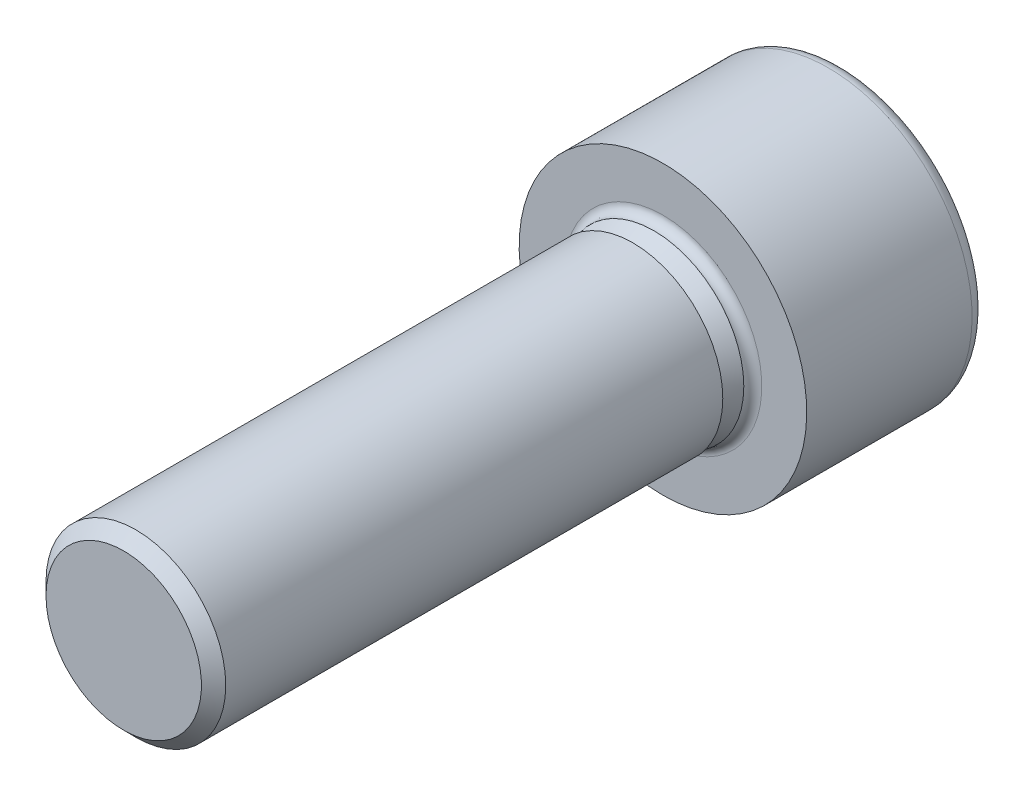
ISO-10303-21;
HEADER;
FILE_DESCRIPTION(('STEP AP214'),'2;1');
FILE_NAME('part.step','',(''),(''),'','','');
FILE_SCHEMA(('AUTOMOTIVE_DESIGN { 1 0 10303 214 1 1 1 1 }'));
ENDSEC;
DATA;
#1=APPLICATION_CONTEXT('core data for automotive mechanical design processes');
#2=APPLICATION_PROTOCOL_DEFINITION('international standard','automotive_design',2000,#1);
#3=PRODUCT_CONTEXT('',#1,'mechanical');
#4=PRODUCT('Part','Part','',(#3));
#5=PRODUCT_RELATED_PRODUCT_CATEGORY('part','',(#4));
#6=PRODUCT_DEFINITION_FORMATION('','',#4);
#7=PRODUCT_DEFINITION_CONTEXT('part definition',#1,'design');
#8=PRODUCT_DEFINITION('design','',#6,#7);
#9=PRODUCT_DEFINITION_SHAPE('','',#8);
#10=(LENGTH_UNIT() NAMED_UNIT(*) SI_UNIT(.MILLI.,.METRE.));
#11=(NAMED_UNIT(*) PLANE_ANGLE_UNIT() SI_UNIT($,.RADIAN.));
#12=(NAMED_UNIT(*) SI_UNIT($,.STERADIAN.) SOLID_ANGLE_UNIT());
#13=UNCERTAINTY_MEASURE_WITH_UNIT(LENGTH_MEASURE(1.E-05),#10,'distance_accuracy_value','');
#14=(GEOMETRIC_REPRESENTATION_CONTEXT(3) GLOBAL_UNCERTAINTY_ASSIGNED_CONTEXT((#13)) GLOBAL_UNIT_ASSIGNED_CONTEXT((#10,
#11,#12)) REPRESENTATION_CONTEXT('',''));
#15=CARTESIAN_POINT('',(0.,0.,0.));
#16=DIRECTION('',(0.,0.,1.));
#17=DIRECTION('',(1.,0.,0.));
#18=AXIS2_PLACEMENT_3D('',#15,#16,#17);
#19=CARTESIAN_POINT('',(0.,0.,-5.01600415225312));
#20=DIRECTION('',(0.,0.,-1.));
#21=DIRECTION('',(0.,1.,0.));
#22=AXIS2_PLACEMENT_3D('',#19,#20,#21);
#23=CONICAL_SURFACE('',#22,4.64771999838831,1.0471975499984);
#24=CARTESIAN_POINT('',(4.62000000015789,-1.08576122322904E-09,-5.00000000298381));
#25=CARTESIAN_POINT('',(4.51848948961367,-0.175821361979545,-4.94137589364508));
#26=CARTESIAN_POINT('',(4.41610274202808,-0.353160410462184,-4.88806033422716));
#27=CARTESIAN_POINT('',(4.2095564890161,-0.710909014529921,-4.79499962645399));
#28=CARTESIAN_POINT('',(4.1053933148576,-0.891324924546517,-4.7552873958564));
#29=CARTESIAN_POINT('',(3.89835780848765,-1.24992094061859,-4.6934724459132));
#30=CARTESIAN_POINT('',(3.7955173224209,-1.42804588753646,-4.67095826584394));
#31=CARTESIAN_POINT('',(3.58935270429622,-1.78513348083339,-4.64408605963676));
#32=CARTESIAN_POINT('',(3.48602932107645,-1.9640948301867,-4.63970577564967));
#33=CARTESIAN_POINT('',(3.29298066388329,-2.29846491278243,-4.64884153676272));
#34=CARTESIAN_POINT('',(3.20322642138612,-2.45392382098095,-4.66011444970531));
#35=CARTESIAN_POINT('',(3.02430265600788,-2.76382887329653,-4.69583574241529));
#36=CARTESIAN_POINT('',(2.93513375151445,-2.91827394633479,-4.72029631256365));
#37=CARTESIAN_POINT('',(2.75584138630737,-3.22881743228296,-4.7814430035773));
#38=CARTESIAN_POINT('',(2.66574060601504,-3.38487656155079,-4.8183882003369));
#39=CARTESIAN_POINT('',(2.48688250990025,-3.69466787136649,-4.90223817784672));
#40=CARTESIAN_POINT('',(2.39812290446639,-3.84840401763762,-4.94912326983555));
#41=CARTESIAN_POINT('',(2.31000000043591,-4.00103736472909,-5.00000000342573));
#42=B_SPLINE_CURVE_WITH_KNOTS('',3,(#24,#25,#26,#27,#28,#29,#30,#31,#32,#33,#34,#35,#36,#37,#38,
#39,#40,#41),.UNSPECIFIED.,.F.,.F.,(4,2,2,2,2,2,2,2,4),(0.,0.634196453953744,1.26991689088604,
1.88990521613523,2.50913233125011,3.04820588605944,3.58777860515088,4.13931646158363,
4.68977188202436),.UNSPECIFIED.);
#43=CARTESIAN_POINT('',(4.61999999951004,0.,-5.00000000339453));
#44=VERTEX_POINT('',#43);
#45=CARTESIAN_POINT('',(2.30999999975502,-4.00103736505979,-5.00000000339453));
#46=VERTEX_POINT('',#45);
#47=EDGE_CURVE('E118',#44,#46,#42,.T.);
#48=ORIENTED_EDGE('',*,*,#47,.T.);
#49=CARTESIAN_POINT('',(2.30999999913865,-4.00103736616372,-5.00000000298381));
#50=CARTESIAN_POINT('',(2.1203719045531,-4.00103736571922,-4.94525335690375));
#51=CARTESIAN_POINT('',(1.92924368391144,-4.00103736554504,-4.89513125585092));
#52=CARTESIAN_POINT('',(1.54388249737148,-4.00103736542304,-4.80654665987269));
#53=CARTESIAN_POINT('',(1.34964358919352,-4.00103736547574,-4.76811025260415));
#54=CARTESIAN_POINT('',(0.963345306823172,-4.00103736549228,-4.70629985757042));
#55=CARTESIAN_POINT('',(0.771340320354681,-4.00103736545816,-4.68259632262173));
#56=CARTESIAN_POINT('',(0.386222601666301,-4.00103736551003,-4.65077573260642));
#57=CARTESIAN_POINT('',(0.19311130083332,-4.00103736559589,-4.64264175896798));
#58=CARTESIAN_POINT('',(-0.193111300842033,-4.00103736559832,-4.6426417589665));
#59=CARTESIAN_POINT('',(-0.386222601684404,-4.0010373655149,-4.65077573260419));
#60=CARTESIAN_POINT('',(-0.771340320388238,-4.00103736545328,-4.68259632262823));
#61=CARTESIAN_POINT('',(-0.963345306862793,-4.00103736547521,-4.70629985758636));
#62=CARTESIAN_POINT('',(-1.34964358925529,-4.00103736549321,-4.76811025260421));
#63=CARTESIAN_POINT('',(-1.54388249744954,-4.00103736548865,-4.80654665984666));
#64=CARTESIAN_POINT('',(-1.92924368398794,-4.00103736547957,-4.89513125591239));
#65=CARTESIAN_POINT('',(-2.12037190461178,-4.00103736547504,-4.94525335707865));
#66=CARTESIAN_POINT('',(-2.30999999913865,-4.00103736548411,-5.00000000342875));
#67=B_SPLINE_CURVE_WITH_KNOTS('',3,(#49,#50,#51,#52,#53,#54,#55,#56,#57,#58,#59,#60,#61,#62,#63,
#64,#65,#66),.UNSPECIFIED.,.F.,.F.,(4,2,2,2,2,2,2,2,4),(0.,0.592300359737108,1.18591344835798,
1.76571952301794,2.34489519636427,2.92407086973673,3.50387694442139,4.09749003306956,
4.68979039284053),.UNSPECIFIED.);
#68=CARTESIAN_POINT('',(-2.30999999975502,-4.00103736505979,-5.00000000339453));
#69=VERTEX_POINT('',#68);
#70=EDGE_CURVE('E139',#46,#69,#67,.T.);
#71=ORIENTED_EDGE('',*,*,#70,.T.);
#72=CARTESIAN_POINT('',(-2.31000000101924,-4.00103736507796,-5.00000000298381));
#73=CARTESIAN_POINT('',(-2.4115105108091,-3.82521600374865,-4.94137589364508));
#74=CARTESIAN_POINT('',(-2.51389725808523,-3.64787695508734,-4.88806033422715));
#75=CARTESIAN_POINT('',(-2.72044351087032,-3.29012835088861,-4.79499962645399));
#76=CARTESIAN_POINT('',(-2.82460668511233,-3.10971244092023,-4.7552873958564));
#77=CARTESIAN_POINT('',(-3.03164219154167,-2.75111642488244,-4.6934724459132));
#78=CARTESIAN_POINT('',(-3.13448267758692,-2.57299147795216,-4.67095826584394));
#79=CARTESIAN_POINT('',(-3.34064729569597,-2.21590388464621,-4.64408605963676));
#80=CARTESIAN_POINT('',(-3.44397067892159,-2.03694253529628,-4.63970577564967));
#81=CARTESIAN_POINT('',(-3.63701933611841,-1.70257245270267,-4.64884153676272));
#82=CARTESIAN_POINT('',(-3.72677357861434,-1.54711354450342,-4.66011444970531));
#83=CARTESIAN_POINT('',(-3.90569734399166,-1.23720849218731,-4.69583574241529));
#84=CARTESIAN_POINT('',(-3.99486624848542,-1.08276341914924,-4.72029631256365));
#85=CARTESIAN_POINT('',(-4.17415861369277,-0.772219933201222,-4.7814430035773));
#86=CARTESIAN_POINT('',(-4.26425939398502,-0.61616080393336,-4.8183882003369));
#87=CARTESIAN_POINT('',(-4.44311749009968,-0.306369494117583,-4.90223817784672));
#88=CARTESIAN_POINT('',(-4.53187709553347,-0.152633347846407,-4.94912326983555));
#89=CARTESIAN_POINT('',(-4.61999999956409,-7.5502287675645E-10,-5.00000000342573));
#90=B_SPLINE_CURVE_WITH_KNOTS('',3,(#72,#73,#74,#75,#76,#77,#78,#79,#80,#81,#82,#83,#84,#85,#86,
#87,#88,#89),.UNSPECIFIED.,.F.,.F.,(4,2,2,2,2,2,2,2,4),(0.,0.634196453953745,1.26991689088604,
1.88990521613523,2.50913233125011,3.04820588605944,3.58777860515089,4.13931646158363,
4.68977188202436),.UNSPECIFIED.);
#91=CARTESIAN_POINT('',(-4.61999999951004,0.,-5.00000000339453));
#92=VERTEX_POINT('',#91);
#93=EDGE_CURVE('E146',#69,#92,#90,.T.);
#94=ORIENTED_EDGE('',*,*,#93,.T.);
#95=CARTESIAN_POINT('',(-4.62000000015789,1.08575708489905E-09,-5.00000000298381));
#96=CARTESIAN_POINT('',(-4.51848948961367,0.17582136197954,-4.94137589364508));
#97=CARTESIAN_POINT('',(-4.41610274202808,0.35316041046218,-4.88806033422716));
#98=CARTESIAN_POINT('',(-4.2095564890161,0.710909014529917,-4.79499962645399));
#99=CARTESIAN_POINT('',(-4.1053933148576,0.891324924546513,-4.7552873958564));
#100=CARTESIAN_POINT('',(-3.89835780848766,1.24992094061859,-4.6934724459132));
#101=CARTESIAN_POINT('',(-3.7955173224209,1.42804588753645,-4.67095826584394));
#102=CARTESIAN_POINT('',(-3.58935270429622,1.78513348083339,-4.64408605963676));
#103=CARTESIAN_POINT('',(-3.48602932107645,1.96409483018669,-4.63970577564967));
#104=CARTESIAN_POINT('',(-3.29298066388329,2.29846491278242,-4.64884153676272));
#105=CARTESIAN_POINT('',(-3.20322642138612,2.45392382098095,-4.6601144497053));
#106=CARTESIAN_POINT('',(-3.02430265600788,2.76382887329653,-4.69583574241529));
#107=CARTESIAN_POINT('',(-2.93513375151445,2.91827394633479,-4.72029631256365));
#108=CARTESIAN_POINT('',(-2.75584138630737,3.22881743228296,-4.7814430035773));
#109=CARTESIAN_POINT('',(-2.66574060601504,3.38487656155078,-4.8183882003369));
#110=CARTESIAN_POINT('',(-2.48688250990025,3.69466787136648,-4.90223817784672));
#111=CARTESIAN_POINT('',(-2.39812290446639,3.84840401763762,-4.94912326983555));
#112=CARTESIAN_POINT('',(-2.31000000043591,4.00103736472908,-5.00000000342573));
#113=B_SPLINE_CURVE_WITH_KNOTS('',3,(#95,#96,#97,#98,#99,#100,#101,#102,#103,#104,#105,#106,
#107,#108,#109,#110,#111,#112),.UNSPECIFIED.,.F.,.F.,(4,2,2,2,2,2,2,2,4),(0.,0.634196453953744,
1.26991689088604,1.88990521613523,2.50913233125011,3.04820588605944,3.58777860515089,
4.13931646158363,4.68977188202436),.UNSPECIFIED.);
#114=CARTESIAN_POINT('',(-2.30999999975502,4.00103736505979,-5.00000000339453));
#115=VERTEX_POINT('',#114);
#116=EDGE_CURVE('E90',#92,#115,#113,.T.);
#117=ORIENTED_EDGE('',*,*,#116,.T.);
#118=CARTESIAN_POINT('',(-2.30999999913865,4.00103736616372,-5.00000000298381));
#119=CARTESIAN_POINT('',(-2.1203719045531,4.00103736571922,-4.94525335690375));
#120=CARTESIAN_POINT('',(-1.92924368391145,4.00103736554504,-4.89513125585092));
#121=CARTESIAN_POINT('',(-1.54388249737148,4.00103736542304,-4.80654665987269));
#122=CARTESIAN_POINT('',(-1.34964358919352,4.00103736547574,-4.76811025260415));
#123=CARTESIAN_POINT('',(-0.963345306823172,4.00103736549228,-4.70629985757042));
#124=CARTESIAN_POINT('',(-0.771340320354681,4.00103736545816,-4.68259632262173));
#125=CARTESIAN_POINT('',(-0.386222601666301,4.00103736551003,-4.65077573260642));
#126=CARTESIAN_POINT('',(-0.193111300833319,4.00103736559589,-4.64264175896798));
#127=CARTESIAN_POINT('',(0.193111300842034,4.00103736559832,-4.6426417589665));
#128=CARTESIAN_POINT('',(0.386222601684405,4.00103736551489,-4.65077573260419));
#129=CARTESIAN_POINT('',(0.771340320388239,4.00103736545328,-4.68259632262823));
#130=CARTESIAN_POINT('',(0.963345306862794,4.00103736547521,-4.70629985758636));
#131=CARTESIAN_POINT('',(1.34964358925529,4.00103736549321,-4.76811025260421));
#132=CARTESIAN_POINT('',(1.54388249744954,4.00103736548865,-4.80654665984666));
#133=CARTESIAN_POINT('',(1.92924368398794,4.00103736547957,-4.89513125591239));
#134=CARTESIAN_POINT('',(2.12037190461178,4.00103736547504,-4.94525335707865));
#135=CARTESIAN_POINT('',(2.30999999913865,4.00103736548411,-5.00000000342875));
#136=B_SPLINE_CURVE_WITH_KNOTS('',3,(#118,#119,#120,#121,#122,#123,#124,#125,#126,#127,#128,
#129,#130,#131,#132,#133,#134,#135),.UNSPECIFIED.,.F.,.F.,(4,2,2,2,2,2,2,2,4),(0.,
0.592300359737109,1.18591344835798,1.76571952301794,2.34489519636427,2.92407086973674,
3.5038769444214,4.09749003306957,4.68979039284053),.UNSPECIFIED.);
#137=CARTESIAN_POINT('',(2.30999999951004,4.00103736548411,-5.00000000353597));
#138=VERTEX_POINT('',#137);
#139=EDGE_CURVE('E82',#115,#138,#136,.T.);
#140=ORIENTED_EDGE('',*,*,#139,.T.);
#141=CARTESIAN_POINT('',(2.31000000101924,4.00103736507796,-5.00000000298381));
#142=CARTESIAN_POINT('',(2.4115105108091,3.82521600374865,-4.94137589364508));
#143=CARTESIAN_POINT('',(2.51389725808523,3.64787695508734,-4.88806033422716));
#144=CARTESIAN_POINT('',(2.72044351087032,3.29012835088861,-4.79499962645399));
#145=CARTESIAN_POINT('',(2.82460668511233,3.10971244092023,-4.7552873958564));
#146=CARTESIAN_POINT('',(3.03164219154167,2.75111642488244,-4.6934724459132));
#147=CARTESIAN_POINT('',(3.13448267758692,2.57299147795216,-4.67095826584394));
#148=CARTESIAN_POINT('',(3.34064729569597,2.21590388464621,-4.64408605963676));
#149=CARTESIAN_POINT('',(3.44397067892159,2.03694253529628,-4.63970577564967));
#150=CARTESIAN_POINT('',(3.63701933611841,1.70257245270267,-4.64884153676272));
#151=CARTESIAN_POINT('',(3.72677357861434,1.54711354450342,-4.66011444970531));
#152=CARTESIAN_POINT('',(3.90569734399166,1.23720849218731,-4.69583574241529));
#153=CARTESIAN_POINT('',(3.99486624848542,1.08276341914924,-4.72029631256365));
#154=CARTESIAN_POINT('',(4.17415861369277,0.772219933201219,-4.7814430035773));
#155=CARTESIAN_POINT('',(4.26425939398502,0.616160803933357,-4.8183882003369));
#156=CARTESIAN_POINT('',(4.44311749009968,0.306369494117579,-4.90223817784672));
#157=CARTESIAN_POINT('',(4.53187709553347,0.152633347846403,-4.94912326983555));
#158=CARTESIAN_POINT('',(4.61999999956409,7.55019377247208E-10,-5.00000000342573));
#159=B_SPLINE_CURVE_WITH_KNOTS('',3,(#141,#142,#143,#144,#145,#146,#147,#148,#149,#150,#151,
#152,#153,#154,#155,#156,#157,#158),.UNSPECIFIED.,.F.,.F.,(4,2,2,2,2,2,2,2,4),(0.,
0.634196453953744,1.26991689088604,1.88990521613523,2.50913233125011,3.04820588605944,
3.58777860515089,4.13931646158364,4.68977188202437),.UNSPECIFIED.);
#160=EDGE_CURVE('E87',#138,#44,#159,.T.);
#161=ORIENTED_EDGE('',*,*,#160,.T.);
#162=EDGE_LOOP('',(#48,#71,#94,#117,#140,#161));
#163=FACE_BOUND('',#162,.T.);
#164=CARTESIAN_POINT('',(0.,-1.13686837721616E-10,-2.33264175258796));
#165=VERTEX_POINT('',#164);
#166=VERTEX_LOOP('',#165);
#167=FACE_BOUND('',#166,.T.);
#168=ADVANCED_FACE('F16',(#163,#167),#23,.F.);
#169=CARTESIAN_POINT('',(-2.31,4.00103736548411,-10.));
#170=DIRECTION('',(0.,1.,0.));
#171=DIRECTION('',(0.,0.,1.));
#172=AXIS2_PLACEMENT_3D('',#169,#170,#171);
#173=PLANE('',#172);
#174=ORIENTED_EDGE('',*,*,#139,.F.);
#175=DIRECTION('',(0.,0.,1.));
#176=VECTOR('',#175,1.);
#177=CARTESIAN_POINT('',(-2.31,4.0010373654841,-10.));
#178=LINE('',#177,#176);
#179=CARTESIAN_POINT('',(-2.31,4.0010373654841,-10.));
#180=VERTEX_POINT('',#179);
#181=EDGE_CURVE('E93',#115,#180,#178,.F.);
#182=ORIENTED_EDGE('',*,*,#181,.T.);
#183=DIRECTION('',(-1.,0.,0.));
#184=VECTOR('',#183,1.);
#185=CARTESIAN_POINT('',(0.,4.00103736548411,-10.));
#186=LINE('',#185,#184);
#187=CARTESIAN_POINT('',(2.31,4.00103736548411,-10.));
#188=VERTEX_POINT('',#187);
#189=EDGE_CURVE('E99',#188,#180,#186,.T.);
#190=ORIENTED_EDGE('',*,*,#189,.F.);
#191=DIRECTION('',(0.,0.,1.));
#192=VECTOR('',#191,1.);
#193=CARTESIAN_POINT('',(2.31,4.00103736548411,-10.));
#194=LINE('',#193,#192);
#195=EDGE_CURVE('E96',#188,#138,#194,.T.);
#196=ORIENTED_EDGE('',*,*,#195,.T.);
#197=EDGE_LOOP('',(#174,#182,#190,#196));
#198=FACE_BOUND('',#197,.T.);
#199=ADVANCED_FACE('F97',(#198),#173,.F.);
#200=CARTESIAN_POINT('',(-4.62,0.,-10.));
#201=DIRECTION('',(-0.866025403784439,0.5,0.));
#202=DIRECTION('',(-0.5,-0.866025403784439,0.));
#203=AXIS2_PLACEMENT_3D('',#200,#201,#202);
#204=PLANE('',#203);
#205=DIRECTION('',(0.,0.,1.));
#206=VECTOR('',#205,1.);
#207=CARTESIAN_POINT('',(-4.62,0.,-10.));
#208=LINE('',#207,#206);
#209=CARTESIAN_POINT('',(-4.62,0.,-10.));
#210=VERTEX_POINT('',#209);
#211=EDGE_CURVE('E154',#92,#210,#208,.F.);
#212=ORIENTED_EDGE('',*,*,#211,.T.);
#213=DIRECTION('',(-0.5,-0.866025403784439,0.));
#214=VECTOR('',#213,1.);
#215=CARTESIAN_POINT('',(-2.31,4.00103736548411,-10.));
#216=LINE('',#215,#214);
#217=EDGE_CURVE('E107',#180,#210,#216,.T.);
#218=ORIENTED_EDGE('',*,*,#217,.F.);
#219=ORIENTED_EDGE('',*,*,#181,.F.);
#220=ORIENTED_EDGE('',*,*,#116,.F.);
#221=EDGE_LOOP('',(#212,#218,#219,#220));
#222=FACE_BOUND('',#221,.T.);
#223=ADVANCED_FACE('F155',(#222),#204,.F.);
#224=CARTESIAN_POINT('',(-2.31,-4.00103736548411,-10.));
#225=DIRECTION('',(-0.866025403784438,-0.5,0.));
#226=DIRECTION('',(0.5,-0.866025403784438,0.));
#227=AXIS2_PLACEMENT_3D('',#224,#225,#226);
#228=PLANE('',#227);
#229=DIRECTION('',(0.,0.,-1.));
#230=VECTOR('',#229,1.);
#231=CARTESIAN_POINT('',(-2.31,-4.00103736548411,-10.));
#232=LINE('',#231,#230);
#233=CARTESIAN_POINT('',(-2.31,-4.00103736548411,-10.));
#234=VERTEX_POINT('',#233);
#235=EDGE_CURVE('E337',#69,#234,#232,.T.);
#236=ORIENTED_EDGE('',*,*,#235,.T.);
#237=DIRECTION('',(0.5,-0.866025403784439,0.));
#238=VECTOR('',#237,1.);
#239=CARTESIAN_POINT('',(-4.62,0.,-10.));
#240=LINE('',#239,#238);
#241=EDGE_CURVE('E268',#210,#234,#240,.T.);
#242=ORIENTED_EDGE('',*,*,#241,.F.);
#243=ORIENTED_EDGE('',*,*,#211,.F.);
#244=ORIENTED_EDGE('',*,*,#93,.F.);
#245=EDGE_LOOP('',(#236,#242,#243,#244));
#246=FACE_BOUND('',#245,.T.);
#247=ADVANCED_FACE('F158',(#246),#228,.F.);
#248=CARTESIAN_POINT('',(2.31,-4.00103736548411,-10.));
#249=DIRECTION('',(0.,-1.,0.));
#250=DIRECTION('',(0.,0.,-1.));
#251=AXIS2_PLACEMENT_3D('',#248,#249,#250);
#252=PLANE('',#251);
#253=ORIENTED_EDGE('',*,*,#70,.F.);
#254=DIRECTION('',(0.,0.,1.));
#255=VECTOR('',#254,1.);
#256=CARTESIAN_POINT('',(2.31,-4.00103736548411,-10.));
#257=LINE('',#256,#255);
#258=CARTESIAN_POINT('',(2.31,-4.00103736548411,-10.));
#259=VERTEX_POINT('',#258);
#260=EDGE_CURVE('E333',#46,#259,#257,.F.);
#261=ORIENTED_EDGE('',*,*,#260,.T.);
#262=DIRECTION('',(-1.,0.,0.));
#263=VECTOR('',#262,1.);
#264=CARTESIAN_POINT('',(0.,-4.00103736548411,-10.));
#265=LINE('',#264,#263);
#266=EDGE_CURVE('E263',#234,#259,#265,.F.);
#267=ORIENTED_EDGE('',*,*,#266,.F.);
#268=ORIENTED_EDGE('',*,*,#235,.F.);
#269=EDGE_LOOP('',(#253,#261,#267,#268));
#270=FACE_BOUND('',#269,.T.);
#271=ADVANCED_FACE('F162',(#270),#252,.F.);
#272=CARTESIAN_POINT('',(4.62,0.,-10.));
#273=DIRECTION('',(0.866025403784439,-0.5,0.));
#274=DIRECTION('',(0.5,0.866025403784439,0.));
#275=AXIS2_PLACEMENT_3D('',#272,#273,#274);
#276=PLANE('',#275);
#277=DIRECTION('',(0.,0.,1.));
#278=VECTOR('',#277,1.);
#279=CARTESIAN_POINT('',(4.62,0.,-10.));
#280=LINE('',#279,#278);
#281=CARTESIAN_POINT('',(4.62,0.,-10.));
#282=VERTEX_POINT('',#281);
#283=EDGE_CURVE('E103',#44,#282,#280,.F.);
#284=ORIENTED_EDGE('',*,*,#283,.T.);
#285=DIRECTION('',(0.5,0.866025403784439,0.));
#286=VECTOR('',#285,1.);
#287=CARTESIAN_POINT('',(2.31,-4.00103736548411,-10.));
#288=LINE('',#287,#286);
#289=EDGE_CURVE('E258',#259,#282,#288,.T.);
#290=ORIENTED_EDGE('',*,*,#289,.F.);
#291=ORIENTED_EDGE('',*,*,#260,.F.);
#292=ORIENTED_EDGE('',*,*,#47,.F.);
#293=EDGE_LOOP('',(#284,#290,#291,#292));
#294=FACE_BOUND('',#293,.T.);
#295=ADVANCED_FACE('F166',(#294),#276,.F.);
#296=CARTESIAN_POINT('',(2.31,4.00103736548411,-10.));
#297=DIRECTION('',(0.866025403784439,0.5,0.));
#298=DIRECTION('',(-0.5,0.866025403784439,0.));
#299=AXIS2_PLACEMENT_3D('',#296,#297,#298);
#300=PLANE('',#299);
#301=ORIENTED_EDGE('',*,*,#195,.F.);
#302=DIRECTION('',(-0.5,0.866025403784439,0.));
#303=VECTOR('',#302,1.);
#304=CARTESIAN_POINT('',(4.62,0.,-10.));
#305=LINE('',#304,#303);
#306=EDGE_CURVE('E256',#282,#188,#305,.T.);
#307=ORIENTED_EDGE('',*,*,#306,.F.);
#308=ORIENTED_EDGE('',*,*,#283,.F.);
#309=ORIENTED_EDGE('',*,*,#160,.F.);
#310=EDGE_LOOP('',(#301,#307,#308,#309));
#311=FACE_BOUND('',#310,.T.);
#312=ADVANCED_FACE('F105',(#311),#300,.F.);
#313=CARTESIAN_POINT('',(0.,-3.6,-10.));
#314=DIRECTION('',(0.,0.,-1.));
#315=DIRECTION('',(-1.,0.,0.));
#316=AXIS2_PLACEMENT_3D('',#313,#314,#315);
#317=PLANE('',#316);
#318=ORIENTED_EDGE('',*,*,#289,.T.);
#319=ORIENTED_EDGE('',*,*,#306,.T.);
#320=ORIENTED_EDGE('',*,*,#189,.T.);
#321=ORIENTED_EDGE('',*,*,#217,.T.);
#322=ORIENTED_EDGE('',*,*,#241,.T.);
#323=ORIENTED_EDGE('',*,*,#266,.T.);
#324=EDGE_LOOP('',(#318,#319,#320,#321,#322,#323));
#325=FACE_BOUND('',#324,.T.);
#326=CARTESIAN_POINT('',(0.,0.,-10.));
#327=DIRECTION('',(0.,0.,1.));
#328=DIRECTION('',(-1.,0.,0.));
#329=AXIS2_PLACEMENT_3D('',#326,#327,#328);
#330=CIRCLE('',#329,7.2);
#331=CARTESIAN_POINT('',(-7.2,0.,-10.));
#332=VERTEX_POINT('',#331);
#333=CARTESIAN_POINT('',(0.,-7.2,-10.));
#334=VERTEX_POINT('',#333);
#335=EDGE_CURVE('E245',#332,#334,#330,.T.);
#336=ORIENTED_EDGE('',*,*,#335,.F.);
#337=CARTESIAN_POINT('',(0.,0.,-10.));
#338=DIRECTION('',(0.,0.,1.));
#339=DIRECTION('',(1.,0.,0.));
#340=AXIS2_PLACEMENT_3D('',#337,#338,#339);
#341=CIRCLE('',#340,7.2);
#342=CARTESIAN_POINT('',(7.2,0.,-10.));
#343=VERTEX_POINT('',#342);
#344=EDGE_CURVE('E37',#343,#332,#341,.T.);
#345=ORIENTED_EDGE('',*,*,#344,.F.);
#346=CARTESIAN_POINT('',(0.,0.,-10.));
#347=DIRECTION('',(0.,0.,1.));
#348=DIRECTION('',(0.,-1.,0.));
#349=AXIS2_PLACEMENT_3D('',#346,#347,#348);
#350=CIRCLE('',#349,7.2);
#351=EDGE_CURVE('E234',#334,#343,#350,.T.);
#352=ORIENTED_EDGE('',*,*,#351,.F.);
#353=EDGE_LOOP('',(#336,#345,#352));
#354=FACE_BOUND('',#353,.T.);
#355=ADVANCED_FACE('F174',(#325,#354),#317,.T.);
#356=CARTESIAN_POINT('',(0.,0.,-9.2));
#357=DIRECTION('',(0.,0.,1.));
#358=DIRECTION('',(-1.,0.,0.));
#359=AXIS2_PLACEMENT_3D('',#356,#357,#358);
#360=TOROIDAL_SURFACE('',#359,7.2,0.8);
#361=ORIENTED_EDGE('',*,*,#344,.T.);
#362=ORIENTED_EDGE('',*,*,#335,.T.);
#363=ORIENTED_EDGE('',*,*,#351,.T.);
#364=EDGE_LOOP('',(#361,#362,#363));
#365=FACE_BOUND('',#364,.T.);
#366=CARTESIAN_POINT('',(0.,0.,-9.2));
#367=DIRECTION('',(0.,0.,1.));
#368=DIRECTION('',(0.,-1.,0.));
#369=AXIS2_PLACEMENT_3D('',#366,#367,#368);
#370=CIRCLE('',#369,8.);
#371=CARTESIAN_POINT('',(0.,-8.,-9.2));
#372=VERTEX_POINT('',#371);
#373=EDGE_CURVE('E231',#372,#372,#370,.T.);
#374=ORIENTED_EDGE('',*,*,#373,.F.);
#375=EDGE_LOOP('',(#374));
#376=FACE_BOUND('',#375,.T.);
#377=ADVANCED_FACE('F208',(#365,#376),#360,.T.);
#378=CARTESIAN_POINT('',(0.,0.,-4.6));
#379=DIRECTION('',(0.,0.,1.));
#380=DIRECTION('',(0.,-1.,0.));
#381=AXIS2_PLACEMENT_3D('',#378,#379,#380);
#382=CYLINDRICAL_SURFACE('',#381,8.);
#383=CARTESIAN_POINT('',(0.,0.,0.));
#384=DIRECTION('',(0.,0.,1.));
#385=DIRECTION('',(0.,-1.,0.));
#386=AXIS2_PLACEMENT_3D('',#383,#384,#385);
#387=CIRCLE('',#386,8.);
#388=CARTESIAN_POINT('',(0.,-8.,0.));
#389=VERTEX_POINT('',#388);
#390=EDGE_CURVE('E116',#389,#389,#387,.T.);
#391=ORIENTED_EDGE('',*,*,#390,.F.);
#392=EDGE_LOOP('',(#391));
#393=FACE_BOUND('',#392,.T.);
#394=ORIENTED_EDGE('',*,*,#373,.T.);
#395=EDGE_LOOP('',(#394));
#396=FACE_BOUND('',#395,.T.);
#397=ADVANCED_FACE('F205',(#393,#396),#382,.T.);
#398=CARTESIAN_POINT('',(0.,-6.75,0.));
#399=DIRECTION('',(0.,0.,1.));
#400=DIRECTION('',(1.,0.,0.));
#401=AXIS2_PLACEMENT_3D('',#398,#399,#400);
#402=PLANE('',#401);
#403=CARTESIAN_POINT('',(0.,0.,0.));
#404=DIRECTION('',(0.,0.,1.));
#405=DIRECTION('',(0.,-1.,0.));
#406=AXIS2_PLACEMENT_3D('',#403,#404,#405);
#407=CIRCLE('',#406,5.5);
#408=CARTESIAN_POINT('',(0.,-5.5,0.));
#409=VERTEX_POINT('',#408);
#410=EDGE_CURVE('E226',#409,#409,#407,.T.);
#411=ORIENTED_EDGE('',*,*,#410,.F.);
#412=EDGE_LOOP('',(#411));
#413=FACE_BOUND('',#412,.T.);
#414=ORIENTED_EDGE('',*,*,#390,.T.);
#415=EDGE_LOOP('',(#414));
#416=FACE_BOUND('',#415,.T.);
#417=ADVANCED_FACE('F202',(#413,#416),#402,.T.);
#418=CARTESIAN_POINT('',(0.,0.,0.5));
#419=DIRECTION('',(0.,0.,1.));
#420=DIRECTION('',(0.,-1.,0.));
#421=AXIS2_PLACEMENT_3D('',#418,#419,#420);
#422=TOROIDAL_SURFACE('',#421,5.5,0.500000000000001);
#423=CARTESIAN_POINT('',(0.,0.,0.5));
#424=DIRECTION('',(0.,0.,1.));
#425=DIRECTION('',(0.,-1.,0.));
#426=AXIS2_PLACEMENT_3D('',#423,#424,#425);
#427=CIRCLE('',#426,5.);
#428=CARTESIAN_POINT('',(0.,-5.,0.5));
#429=VERTEX_POINT('',#428);
#430=EDGE_CURVE('E223',#429,#429,#427,.T.);
#431=ORIENTED_EDGE('',*,*,#430,.F.);
#432=EDGE_LOOP('',(#431));
#433=FACE_BOUND('',#432,.T.);
#434=ORIENTED_EDGE('',*,*,#410,.T.);
#435=EDGE_LOOP('',(#434));
#436=FACE_BOUND('',#435,.T.);
#437=ADVANCED_FACE('F18',(#433,#436),#422,.F.);
#438=CARTESIAN_POINT('',(0.,0.,0.500499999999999));
#439=DIRECTION('',(0.,0.,1.));
#440=DIRECTION('',(0.,-1.,0.));
#441=AXIS2_PLACEMENT_3D('',#438,#439,#440);
#442=CYLINDRICAL_SURFACE('',#441,5.);
#443=CARTESIAN_POINT('',(0.,0.,0.500999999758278));
#444=DIRECTION('',(0.,0.,-1.));
#445=DIRECTION('',(0.,-1.,0.));
#446=AXIS2_PLACEMENT_3D('',#443,#444,#445);
#447=CIRCLE('',#446,4.99999999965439);
#448=CARTESIAN_POINT('',(0.,-4.99999999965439,0.500999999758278));
#449=VERTEX_POINT('',#448);
#450=EDGE_CURVE('E225',#449,#449,#447,.F.);
#451=ORIENTED_EDGE('',*,*,#450,.F.);
#452=EDGE_LOOP('',(#451));
#453=FACE_BOUND('',#452,.T.);
#454=ORIENTED_EDGE('',*,*,#430,.T.);
#455=EDGE_LOOP('',(#454));
#456=FACE_BOUND('',#455,.T.);
#457=ADVANCED_FACE('F197',(#453,#456),#442,.T.);
#458=CARTESIAN_POINT('',(0.,0.,0.500999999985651));
#459=DIRECTION('',(0.,0.,-1.));
#460=DIRECTION('',(0.,1.,0.));
#461=AXIS2_PLACEMENT_3D('',#458,#459,#460);
#462=CONICAL_SURFACE('',#461,4.99999999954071,0.524338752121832);
#463=CARTESIAN_POINT('',(0.,0.,1.67084062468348));
#464=DIRECTION('',(0.,0.,-1.));
#465=DIRECTION('',(0.,1.,0.));
#466=AXIS2_PLACEMENT_3D('',#463,#464,#465);
#467=CIRCLE('',#466,4.32343750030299);
#468=CARTESIAN_POINT('',(0.,4.32343750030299,1.67084062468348));
#469=VERTEX_POINT('',#468);
#470=EDGE_CURVE('E230',#469,#469,#467,.F.);
#471=ORIENTED_EDGE('',*,*,#470,.F.);
#472=EDGE_LOOP('',(#471));
#473=FACE_BOUND('',#472,.T.);
#474=ORIENTED_EDGE('',*,*,#450,.T.);
#475=EDGE_LOOP('',(#474));
#476=FACE_BOUND('',#475,.T.);
#477=ADVANCED_FACE('F193',(#473,#476),#462,.T.);
#478=CARTESIAN_POINT('',(0.,-2.16171875,30.));
#479=DIRECTION('',(0.,0.,1.));
#480=DIRECTION('',(1.,0.,0.));
#481=AXIS2_PLACEMENT_3D('',#478,#479,#480);
#482=PLANE('',#481);
#483=CARTESIAN_POINT('',(0.,0.,30.0000000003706));
#484=DIRECTION('',(0.,0.,-1.));
#485=DIRECTION('',(-1.,0.,0.));
#486=AXIS2_PLACEMENT_3D('',#483,#484,#485);
#487=CIRCLE('',#486,4.32343750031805);
#488=CARTESIAN_POINT('',(-4.32343750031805,0.,30.0000000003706));
#489=VERTEX_POINT('',#488);
#490=EDGE_CURVE('E280',#489,#489,#487,.T.);
#491=ORIENTED_EDGE('',*,*,#490,.F.);
#492=EDGE_LOOP('',(#491));
#493=FACE_BOUND('',#492,.T.);
#494=ADVANCED_FACE('F189',(#493),#482,.T.);
#495=CARTESIAN_POINT('',(0.,-4.66171875,1.67084062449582));
#496=DIRECTION('',(0.,0.,-1.));
#497=DIRECTION('',(-1.,0.,0.));
#498=AXIS2_PLACEMENT_3D('',#495,#496,#497);
#499=PLANE('',#498);
#500=ORIENTED_EDGE('',*,*,#470,.T.);
#501=EDGE_LOOP('',(#500));
#502=FACE_BOUND('',#501,.T.);
#503=CARTESIAN_POINT('',(0.,0.,1.67084062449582));
#504=DIRECTION('',(0.,0.,1.));
#505=DIRECTION('',(0.,-1.,0.));
#506=AXIS2_PLACEMENT_3D('',#503,#504,#505);
#507=CIRCLE('',#506,5.);
#508=CARTESIAN_POINT('',(0.,-5.,1.67084062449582));
#509=VERTEX_POINT('',#508);
#510=EDGE_CURVE('E28',#509,#509,#507,.T.);
#511=ORIENTED_EDGE('',*,*,#510,.F.);
#512=EDGE_LOOP('',(#511));
#513=FACE_BOUND('',#512,.T.);
#514=ADVANCED_FACE('F181',(#502,#513),#499,.T.);
#515=CARTESIAN_POINT('',(0.,0.,29.3234374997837));
#516=DIRECTION('',(0.,0.,-1.));
#517=DIRECTION('',(-1.,0.,0.));
#518=AXIS2_PLACEMENT_3D('',#515,#516,#517);
#519=CONICAL_SURFACE('',#518,4.9999999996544,0.785398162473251);
#520=ORIENTED_EDGE('',*,*,#490,.T.);
#521=EDGE_LOOP('',(#520));
#522=FACE_BOUND('',#521,.T.);
#523=CARTESIAN_POINT('',(0.,0.,29.3234375));
#524=DIRECTION('',(0.,0.,1.));
#525=DIRECTION('',(0.,-1.,0.));
#526=AXIS2_PLACEMENT_3D('',#523,#524,#525);
#527=CIRCLE('',#526,5.);
#528=CARTESIAN_POINT('',(0.,-5.,29.3234375));
#529=VERTEX_POINT('',#528);
#530=EDGE_CURVE('E10',#529,#529,#527,.F.);
#531=ORIENTED_EDGE('',*,*,#530,.F.);
#532=EDGE_LOOP('',(#531));
#533=FACE_BOUND('',#532,.T.);
#534=ADVANCED_FACE('F177',(#522,#533),#519,.T.);
#535=CARTESIAN_POINT('',(0.,0.,15.4971390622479));
#536=DIRECTION('',(0.,0.,1.));
#537=DIRECTION('',(0.,-1.,0.));
#538=AXIS2_PLACEMENT_3D('',#535,#536,#537);
#539=CYLINDRICAL_SURFACE('',#538,5.);
#540=ORIENTED_EDGE('',*,*,#510,.T.);
#541=EDGE_LOOP('',(#540));
#542=FACE_BOUND('',#541,.T.);
#543=ORIENTED_EDGE('',*,*,#530,.T.);
#544=EDGE_LOOP('',(#543));
#545=FACE_BOUND('',#544,.T.);
#546=ADVANCED_FACE('F175',(#542,#545),#539,.T.);
#547=CLOSED_SHELL('',(#168,#199,#223,#247,#271,#295,#312,#355,#377,#397,#417,#437,#457,#477,
#494,#514,#534,#546));
#548=MANIFOLD_SOLID_BREP('B1',#547);
#549=ADVANCED_BREP_SHAPE_REPRESENTATION('',(#18,#548),#14);
#550=SHAPE_DEFINITION_REPRESENTATION(#9,#549);
ENDSEC;
END-ISO-10303-21;
